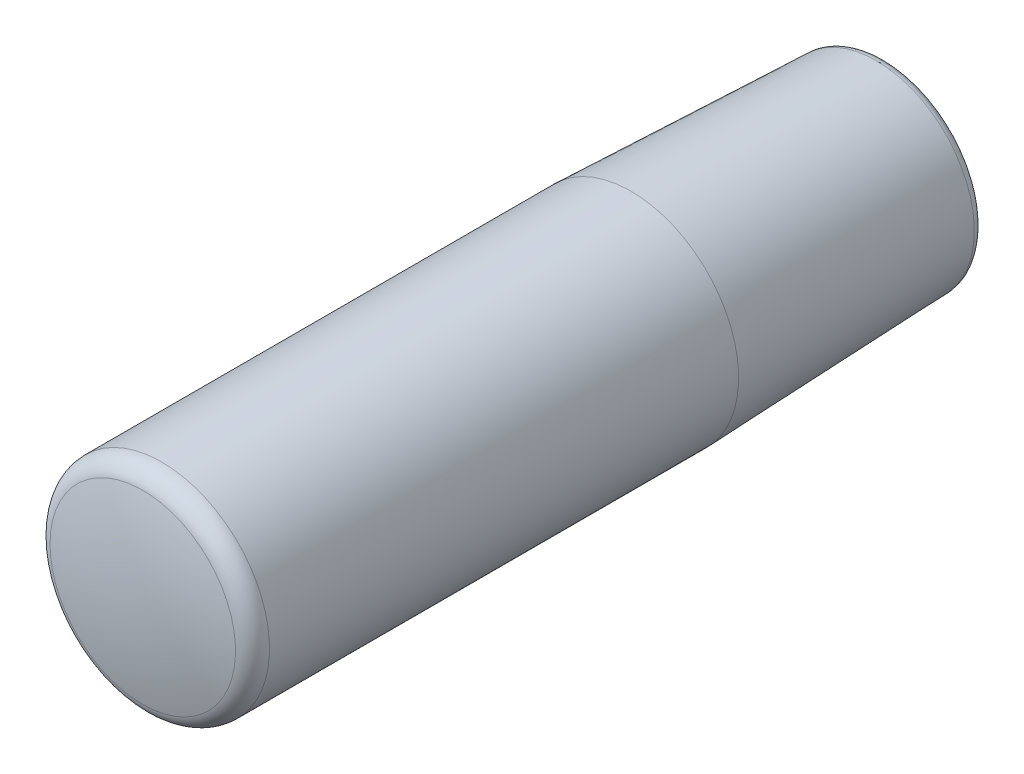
ISO-10303-21;
HEADER;
FILE_DESCRIPTION(('STEP AP214'),'2;1');
FILE_NAME('part.step','',(''),(''),'','','');
FILE_SCHEMA(('AUTOMOTIVE_DESIGN { 1 0 10303 214 1 1 1 1 }'));
ENDSEC;
DATA;
#1=APPLICATION_CONTEXT('core data for automotive mechanical design processes');
#2=APPLICATION_PROTOCOL_DEFINITION('international standard','automotive_design',2000,#1);
#3=PRODUCT_CONTEXT('',#1,'mechanical');
#4=PRODUCT('Part','Part','',(#3));
#5=PRODUCT_RELATED_PRODUCT_CATEGORY('part','',(#4));
#6=PRODUCT_DEFINITION_FORMATION('','',#4);
#7=PRODUCT_DEFINITION_CONTEXT('part definition',#1,'design');
#8=PRODUCT_DEFINITION('design','',#6,#7);
#9=PRODUCT_DEFINITION_SHAPE('','',#8);
#10=(LENGTH_UNIT() NAMED_UNIT(*) SI_UNIT(.MILLI.,.METRE.));
#11=(NAMED_UNIT(*) PLANE_ANGLE_UNIT() SI_UNIT($,.RADIAN.));
#12=(NAMED_UNIT(*) SI_UNIT($,.STERADIAN.) SOLID_ANGLE_UNIT());
#13=UNCERTAINTY_MEASURE_WITH_UNIT(LENGTH_MEASURE(1.E-05),#10,'distance_accuracy_value','');
#14=(GEOMETRIC_REPRESENTATION_CONTEXT(3) GLOBAL_UNCERTAINTY_ASSIGNED_CONTEXT((#13)) GLOBAL_UNIT_ASSIGNED_CONTEXT((#10,
#11,#12)) REPRESENTATION_CONTEXT('',''));
#15=CARTESIAN_POINT('',(0.,0.,0.));
#16=DIRECTION('',(0.,0.,1.));
#17=DIRECTION('',(1.,0.,0.));
#18=AXIS2_PLACEMENT_3D('',#15,#16,#17);
#19=CARTESIAN_POINT('',(0.,0.,15.));
#20=DIRECTION('',(0.,0.,1.));
#21=DIRECTION('',(1.,0.,0.));
#22=AXIS2_PLACEMENT_3D('',#19,#20,#21);
#23=PLANE('',#22);
#24=CARTESIAN_POINT('',(0.,0.,15.));
#25=DIRECTION('',(0.,0.,-1.));
#26=DIRECTION('',(-1.,0.,0.));
#27=AXIS2_PLACEMENT_3D('',#24,#25,#26);
#28=CIRCLE('',#27,5.00000000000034);
#29=CARTESIAN_POINT('',(-5.00000000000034,0.,15.));
#30=VERTEX_POINT('',#29);
#31=EDGE_CURVE('E41',#30,#30,#28,.T.);
#32=ORIENTED_EDGE('',*,*,#31,.T.);
#33=EDGE_LOOP('',(#32));
#34=FACE_BOUND('',#33,.T.);
#35=ADVANCED_FACE('F12',(#34),#23,.F.);
#36=CARTESIAN_POINT('',(0.,0.,37.));
#37=DIRECTION('',(0.,0.,-1.));
#38=DIRECTION('',(0.,-1.,0.));
#39=AXIS2_PLACEMENT_3D('',#36,#37,#38);
#40=SPHERICAL_SURFACE('',#39,40.);
#41=CARTESIAN_POINT('',(0.,0.,75.861926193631));
#42=DIRECTION('',(0.,0.,-1.));
#43=DIRECTION('',(-1.,0.,0.));
#44=AXIS2_PLACEMENT_3D('',#41,#42,#43);
#45=CIRCLE('',#44,9.47368421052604);
#46=CARTESIAN_POINT('',(-9.47368421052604,0.,75.861926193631));
#47=VERTEX_POINT('',#46);
#48=EDGE_CURVE('E23',#47,#47,#45,.T.);
#49=ORIENTED_EDGE('',*,*,#48,.F.);
#50=EDGE_LOOP('',(#49));
#51=FACE_BOUND('',#50,.T.);
#52=ADVANCED_FACE('F60',(#51),#40,.T.);
#53=CARTESIAN_POINT('',(0.,0.,73.9188298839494));
#54=DIRECTION('',(0.,0.,-1.));
#55=DIRECTION('',(-1.,0.,0.));
#56=AXIS2_PLACEMENT_3D('',#53,#54,#55);
#57=TOROIDAL_SURFACE('',#56,9.,2.);
#58=CARTESIAN_POINT('',(0.,0.,73.9188298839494));
#59=DIRECTION('',(0.,0.,-1.));
#60=DIRECTION('',(-1.,0.,0.));
#61=AXIS2_PLACEMENT_3D('',#58,#59,#60);
#62=CIRCLE('',#61,11.);
#63=CARTESIAN_POINT('',(-11.,0.,73.9188298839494));
#64=VERTEX_POINT('',#63);
#65=EDGE_CURVE('E27',#64,#64,#62,.T.);
#66=ORIENTED_EDGE('',*,*,#65,.F.);
#67=EDGE_LOOP('',(#66));
#68=FACE_BOUND('',#67,.T.);
#69=ORIENTED_EDGE('',*,*,#48,.T.);
#70=EDGE_LOOP('',(#69));
#71=FACE_BOUND('',#70,.T.);
#72=ADVANCED_FACE('F65',(#68,#71),#57,.T.);
#73=CARTESIAN_POINT('',(0.,0.,15.));
#74=DIRECTION('',(0.,0.,-1.));
#75=DIRECTION('',(-1.,0.,0.));
#76=AXIS2_PLACEMENT_3D('',#73,#74,#75);
#77=CYLINDRICAL_SURFACE('',#76,11.);
#78=CARTESIAN_POINT('',(0.,0.,26.));
#79=DIRECTION('',(0.,0.,-1.));
#80=DIRECTION('',(-1.,0.,0.));
#81=AXIS2_PLACEMENT_3D('',#78,#79,#80);
#82=CIRCLE('',#81,11.);
#83=CARTESIAN_POINT('',(-11.,0.,26.));
#84=VERTEX_POINT('',#83);
#85=EDGE_CURVE('E32',#84,#84,#82,.T.);
#86=ORIENTED_EDGE('',*,*,#85,.F.);
#87=EDGE_LOOP('',(#86));
#88=FACE_BOUND('',#87,.T.);
#89=ORIENTED_EDGE('',*,*,#65,.T.);
#90=EDGE_LOOP('',(#89));
#91=FACE_BOUND('',#90,.T.);
#92=ADVANCED_FACE('F71',(#88,#91),#77,.T.);
#93=CARTESIAN_POINT('',(0.,0.,26.));
#94=DIRECTION('',(0.,0.,1.));
#95=DIRECTION('',(1.,0.,0.));
#96=AXIS2_PLACEMENT_3D('',#93,#94,#95);
#97=CONICAL_SURFACE('',#96,11.,0.0384425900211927);
#98=CARTESIAN_POINT('',(0.,0.,0.961566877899));
#99=DIRECTION('',(0.,0.,-1.));
#100=DIRECTION('',(-1.,0.,0.));
#101=AXIS2_PLACEMENT_3D('',#98,#99,#100);
#102=CIRCLE('',#101,10.0369833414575);
#103=CARTESIAN_POINT('',(-10.0369833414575,0.,0.961566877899));
#104=VERTEX_POINT('',#103);
#105=EDGE_CURVE('E35',#104,#104,#102,.T.);
#106=ORIENTED_EDGE('',*,*,#105,.F.);
#107=EDGE_LOOP('',(#106));
#108=FACE_BOUND('',#107,.T.);
#109=ORIENTED_EDGE('',*,*,#85,.T.);
#110=EDGE_LOOP('',(#109));
#111=FACE_BOUND('',#110,.T.);
#112=ADVANCED_FACE('F75',(#108,#111),#97,.T.);
#113=CARTESIAN_POINT('',(0.,0.,1.));
#114=DIRECTION('',(0.,0.,-1.));
#115=DIRECTION('',(-1.,0.,0.));
#116=AXIS2_PLACEMENT_3D('',#113,#114,#115);
#117=TOROIDAL_SURFACE('',#116,9.03772216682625,0.999999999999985);
#118=CARTESIAN_POINT('',(0.,0.,0.));
#119=DIRECTION('',(0.,0.,-1.));
#120=DIRECTION('',(-1.,0.,0.));
#121=AXIS2_PLACEMENT_3D('',#118,#119,#120);
#122=CIRCLE('',#121,9.03772216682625);
#123=CARTESIAN_POINT('',(-9.03772216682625,0.,0.));
#124=VERTEX_POINT('',#123);
#125=EDGE_CURVE('E38',#124,#124,#122,.T.);
#126=ORIENTED_EDGE('',*,*,#125,.F.);
#127=EDGE_LOOP('',(#126));
#128=FACE_BOUND('',#127,.T.);
#129=ORIENTED_EDGE('',*,*,#105,.T.);
#130=EDGE_LOOP('',(#129));
#131=FACE_BOUND('',#130,.T.);
#132=ADVANCED_FACE('F57',(#128,#131),#117,.T.);
#133=CARTESIAN_POINT('',(0.,-5.,0.));
#134=DIRECTION('',(0.,0.,1.));
#135=DIRECTION('',(1.,0.,0.));
#136=AXIS2_PLACEMENT_3D('',#133,#134,#135);
#137=PLANE('',#136);
#138=CARTESIAN_POINT('',(0.,0.,0.));
#139=DIRECTION('',(0.,0.,1.));
#140=DIRECTION('',(1.,0.,0.));
#141=AXIS2_PLACEMENT_3D('',#138,#139,#140);
#142=CIRCLE('',#141,5.65);
#143=CARTESIAN_POINT('',(5.65,0.,0.));
#144=VERTEX_POINT('',#143);
#145=EDGE_CURVE('E8',#144,#144,#142,.T.);
#146=ORIENTED_EDGE('',*,*,#145,.T.);
#147=EDGE_LOOP('',(#146));
#148=FACE_BOUND('',#147,.T.);
#149=ORIENTED_EDGE('',*,*,#125,.T.);
#150=EDGE_LOOP('',(#149));
#151=FACE_BOUND('',#150,.T.);
#152=ADVANCED_FACE('F48',(#148,#151),#137,.F.);
#153=CARTESIAN_POINT('',(0.,0.,15.));
#154=DIRECTION('',(0.,0.,-1.));
#155=DIRECTION('',(-1.,0.,0.));
#156=AXIS2_PLACEMENT_3D('',#153,#154,#155);
#157=CYLINDRICAL_SURFACE('',#156,5.00000000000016);
#158=CARTESIAN_POINT('',(0.,0.,0.649999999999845));
#159=DIRECTION('',(0.,0.,1.));
#160=DIRECTION('',(1.,0.,0.));
#161=AXIS2_PLACEMENT_3D('',#158,#159,#160);
#162=CIRCLE('',#161,5.00000000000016);
#163=CARTESIAN_POINT('',(5.00000000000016,0.,0.649999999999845));
#164=VERTEX_POINT('',#163);
#165=EDGE_CURVE('E19',#164,#164,#162,.F.);
#166=ORIENTED_EDGE('',*,*,#165,.T.);
#167=EDGE_LOOP('',(#166));
#168=FACE_BOUND('',#167,.T.);
#169=ORIENTED_EDGE('',*,*,#31,.F.);
#170=EDGE_LOOP('',(#169));
#171=FACE_BOUND('',#170,.T.);
#172=ADVANCED_FACE('F46',(#168,#171),#157,.F.);
#173=CARTESIAN_POINT('',(0.,0.,0.649999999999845));
#174=DIRECTION('',(0.,0.,-1.));
#175=DIRECTION('',(-1.,0.,0.));
#176=AXIS2_PLACEMENT_3D('',#173,#174,#175);
#177=CONICAL_SURFACE('',#176,5.00000000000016,0.785398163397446);
#178=ORIENTED_EDGE('',*,*,#145,.F.);
#179=EDGE_LOOP('',(#178));
#180=FACE_BOUND('',#179,.T.);
#181=ORIENTED_EDGE('',*,*,#165,.F.);
#182=EDGE_LOOP('',(#181));
#183=FACE_BOUND('',#182,.T.);
#184=ADVANCED_FACE('F14',(#180,#183),#177,.F.);
#185=CLOSED_SHELL('',(#35,#52,#72,#92,#112,#132,#152,#172,#184));
#186=MANIFOLD_SOLID_BREP('B1',#185);
#187=ADVANCED_BREP_SHAPE_REPRESENTATION('',(#18,#186),#14);
#188=SHAPE_DEFINITION_REPRESENTATION(#9,#187);
ENDSEC;
END-ISO-10303-21;
